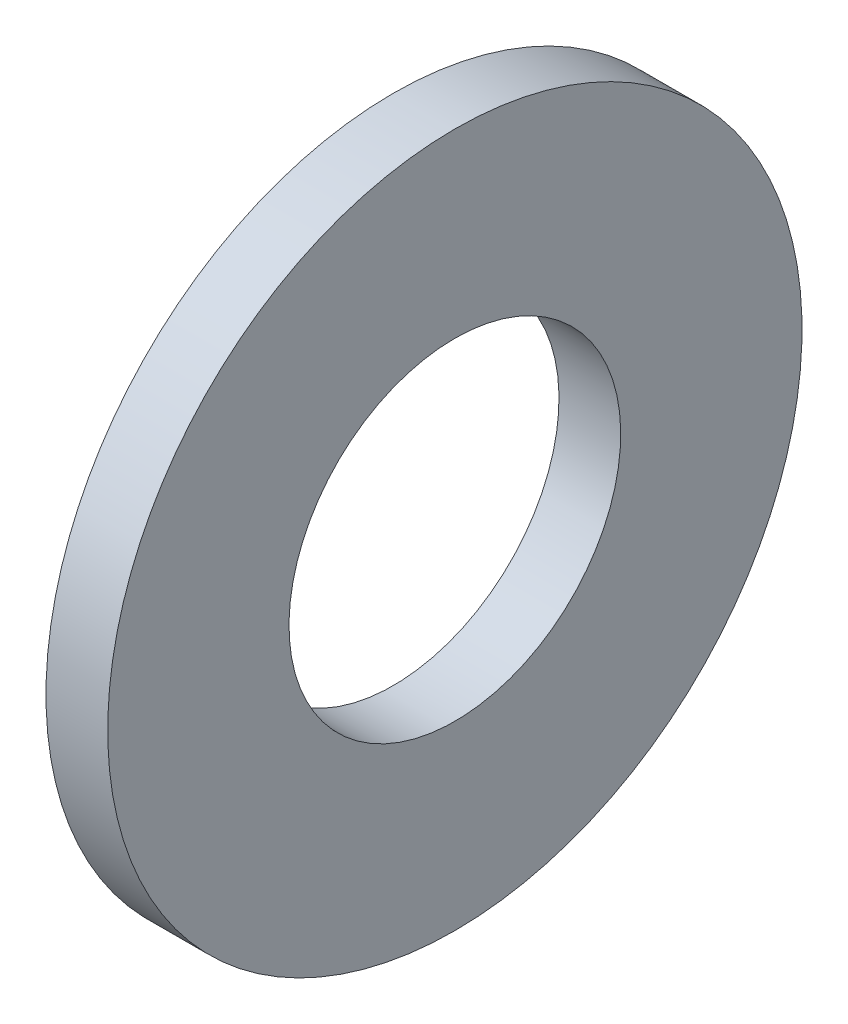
ISO-10303-21;
HEADER;
FILE_DESCRIPTION(('STEP AP214'),'2;1');
FILE_NAME('part.step','',(''),(''),'','','');
FILE_SCHEMA(('AUTOMOTIVE_DESIGN { 1 0 10303 214 1 1 1 1 }'));
ENDSEC;
DATA;
#1=APPLICATION_CONTEXT('core data for automotive mechanical design processes');
#2=APPLICATION_PROTOCOL_DEFINITION('international standard','automotive_design',2000,#1);
#3=PRODUCT_CONTEXT('',#1,'mechanical');
#4=PRODUCT('Part','Part','',(#3));
#5=PRODUCT_RELATED_PRODUCT_CATEGORY('part','',(#4));
#6=PRODUCT_DEFINITION_FORMATION('','',#4);
#7=PRODUCT_DEFINITION_CONTEXT('part definition',#1,'design');
#8=PRODUCT_DEFINITION('design','',#6,#7);
#9=PRODUCT_DEFINITION_SHAPE('','',#8);
#10=(LENGTH_UNIT() NAMED_UNIT(*) SI_UNIT(.MILLI.,.METRE.));
#11=(NAMED_UNIT(*) PLANE_ANGLE_UNIT() SI_UNIT($,.RADIAN.));
#12=(NAMED_UNIT(*) SI_UNIT($,.STERADIAN.) SOLID_ANGLE_UNIT());
#13=UNCERTAINTY_MEASURE_WITH_UNIT(LENGTH_MEASURE(1.E-05),#10,'distance_accuracy_value','');
#14=(GEOMETRIC_REPRESENTATION_CONTEXT(3) GLOBAL_UNCERTAINTY_ASSIGNED_CONTEXT((#13)) GLOBAL_UNIT_ASSIGNED_CONTEXT((#10,
#11,#12)) REPRESENTATION_CONTEXT('',''));
#15=CARTESIAN_POINT('',(0.,0.,0.));
#16=DIRECTION('',(0.,0.,1.));
#17=DIRECTION('',(1.,0.,0.));
#18=AXIS2_PLACEMENT_3D('',#15,#16,#17);
#19=CARTESIAN_POINT('',(0.4,0.,0.));
#20=DIRECTION('',(1.,0.,0.));
#21=DIRECTION('',(0.,1.,0.));
#22=AXIS2_PLACEMENT_3D('',#19,#20,#21);
#23=CIRCLE('',#22,2.15);
#24=DIRECTION('',(-1.,0.,0.));
#25=VECTOR('',#24,1.);
#26=SURFACE_OF_LINEAR_EXTRUSION('',#23,#25);
#27=CARTESIAN_POINT('',(0.8,0.,0.));
#28=DIRECTION('',(-1.,0.,0.));
#29=DIRECTION('',(0.,1.,0.));
#30=AXIS2_PLACEMENT_3D('',#27,#28,#29);
#31=CIRCLE('',#30,2.15);
#32=CARTESIAN_POINT('',(0.8,2.15,0.));
#33=VERTEX_POINT('',#32);
#34=EDGE_CURVE('E28',#33,#33,#31,.T.);
#35=ORIENTED_EDGE('',*,*,#34,.F.);
#36=EDGE_LOOP('',(#35));
#37=FACE_BOUND('',#36,.T.);
#38=CARTESIAN_POINT('',(0.,0.,0.));
#39=DIRECTION('',(-1.,0.,0.));
#40=DIRECTION('',(0.,1.,0.));
#41=AXIS2_PLACEMENT_3D('',#38,#39,#40);
#42=CIRCLE('',#41,2.15);
#43=CARTESIAN_POINT('',(0.,2.15,0.));
#44=VERTEX_POINT('',#43);
#45=EDGE_CURVE('E31',#44,#44,#42,.T.);
#46=ORIENTED_EDGE('',*,*,#45,.T.);
#47=EDGE_LOOP('',(#46));
#48=FACE_BOUND('',#47,.T.);
#49=ADVANCED_FACE('F15',(#37,#48),#26,.T.);
#50=CARTESIAN_POINT('',(0.,3.325,0.));
#51=DIRECTION('',(-1.,0.,0.));
#52=DIRECTION('',(0.,-1.,0.));
#53=AXIS2_PLACEMENT_3D('',#50,#51,#52);
#54=PLANE('',#53);
#55=CARTESIAN_POINT('',(0.,0.,0.));
#56=DIRECTION('',(-1.,0.,0.));
#57=DIRECTION('',(0.,1.,0.));
#58=AXIS2_PLACEMENT_3D('',#55,#56,#57);
#59=CIRCLE('',#58,4.5);
#60=CARTESIAN_POINT('',(0.,4.5,0.));
#61=VERTEX_POINT('',#60);
#62=EDGE_CURVE('E10',#61,#61,#59,.T.);
#63=ORIENTED_EDGE('',*,*,#62,.T.);
#64=EDGE_LOOP('',(#63));
#65=FACE_BOUND('',#64,.T.);
#66=ORIENTED_EDGE('',*,*,#45,.F.);
#67=EDGE_LOOP('',(#66));
#68=FACE_BOUND('',#67,.T.);
#69=ADVANCED_FACE('F39',(#65,#68),#54,.T.);
#70=CARTESIAN_POINT('',(0.4,0.,0.));
#71=DIRECTION('',(-1.,0.,0.));
#72=DIRECTION('',(0.,-1.,0.));
#73=AXIS2_PLACEMENT_3D('',#70,#71,#72);
#74=CYLINDRICAL_SURFACE('',#73,4.5);
#75=CARTESIAN_POINT('',(0.8,0.,0.));
#76=DIRECTION('',(-1.,0.,0.));
#77=DIRECTION('',(0.,1.,0.));
#78=AXIS2_PLACEMENT_3D('',#75,#76,#77);
#79=CIRCLE('',#78,4.5);
#80=CARTESIAN_POINT('',(0.8,4.5,0.));
#81=VERTEX_POINT('',#80);
#82=EDGE_CURVE('E23',#81,#81,#79,.T.);
#83=ORIENTED_EDGE('',*,*,#82,.T.);
#84=EDGE_LOOP('',(#83));
#85=FACE_BOUND('',#84,.T.);
#86=ORIENTED_EDGE('',*,*,#62,.F.);
#87=EDGE_LOOP('',(#86));
#88=FACE_BOUND('',#87,.T.);
#89=ADVANCED_FACE('F41',(#85,#88),#74,.T.);
#90=CARTESIAN_POINT('',(0.8,3.325,0.));
#91=DIRECTION('',(1.,0.,0.));
#92=DIRECTION('',(0.,1.,0.));
#93=AXIS2_PLACEMENT_3D('',#90,#91,#92);
#94=PLANE('',#93);
#95=ORIENTED_EDGE('',*,*,#34,.T.);
#96=EDGE_LOOP('',(#95));
#97=FACE_BOUND('',#96,.T.);
#98=ORIENTED_EDGE('',*,*,#82,.F.);
#99=EDGE_LOOP('',(#98));
#100=FACE_BOUND('',#99,.T.);
#101=ADVANCED_FACE('F17',(#97,#100),#94,.T.);
#102=CLOSED_SHELL('',(#49,#69,#89,#101));
#103=MANIFOLD_SOLID_BREP('B1',#102);
#104=ADVANCED_BREP_SHAPE_REPRESENTATION('',(#18,#103),#14);
#105=SHAPE_DEFINITION_REPRESENTATION(#9,#104);
ENDSEC;
END-ISO-10303-21;
